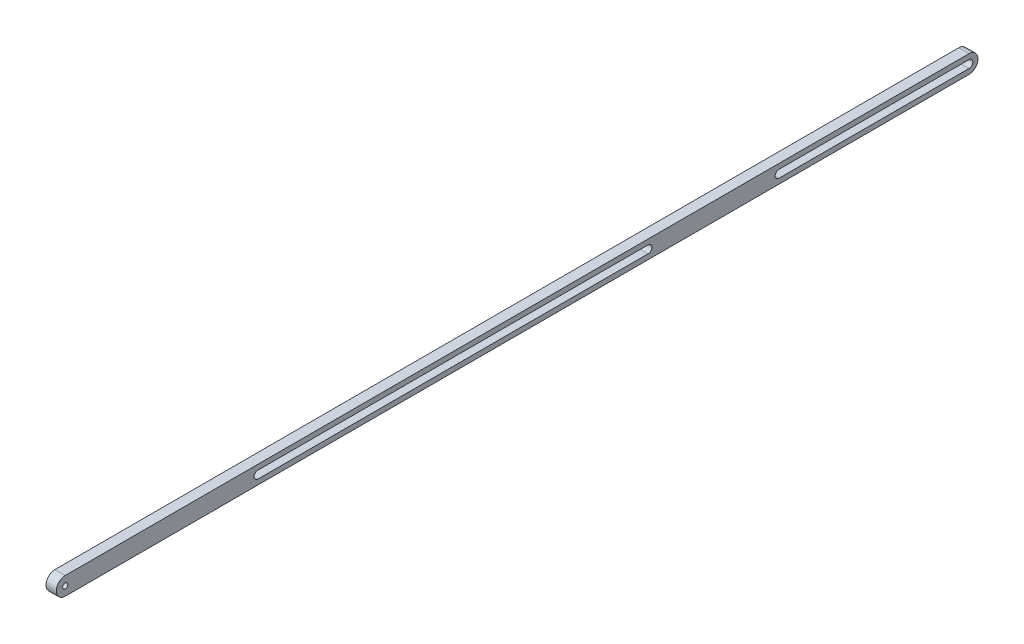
ISO-10303-21;
HEADER;
FILE_DESCRIPTION(('STEP AP214'),'2;1');
FILE_NAME('part.step','',(''),(''),'','','');
FILE_SCHEMA(('AUTOMOTIVE_DESIGN { 1 0 10303 214 1 1 1 1 }'));
ENDSEC;
DATA;
#1=APPLICATION_CONTEXT('core data for automotive mechanical design processes');
#2=APPLICATION_PROTOCOL_DEFINITION('international standard','automotive_design',2000,#1);
#3=PRODUCT_CONTEXT('',#1,'mechanical');
#4=PRODUCT('Part','Part','',(#3));
#5=PRODUCT_RELATED_PRODUCT_CATEGORY('part','',(#4));
#6=PRODUCT_DEFINITION_FORMATION('','',#4);
#7=PRODUCT_DEFINITION_CONTEXT('part definition',#1,'design');
#8=PRODUCT_DEFINITION('design','',#6,#7);
#9=PRODUCT_DEFINITION_SHAPE('','',#8);
#10=(LENGTH_UNIT() NAMED_UNIT(*) SI_UNIT(.MILLI.,.METRE.));
#11=(NAMED_UNIT(*) PLANE_ANGLE_UNIT() SI_UNIT($,.RADIAN.));
#12=(NAMED_UNIT(*) SI_UNIT($,.STERADIAN.) SOLID_ANGLE_UNIT());
#13=UNCERTAINTY_MEASURE_WITH_UNIT(LENGTH_MEASURE(1.E-05),#10,'distance_accuracy_value','');
#14=(GEOMETRIC_REPRESENTATION_CONTEXT(3) GLOBAL_UNCERTAINTY_ASSIGNED_CONTEXT((#13)) GLOBAL_UNIT_ASSIGNED_CONTEXT((#10,
#11,#12)) REPRESENTATION_CONTEXT('',''));
#15=CARTESIAN_POINT('',(0.,0.,0.));
#16=DIRECTION('',(0.,0.,1.));
#17=DIRECTION('',(1.,0.,0.));
#18=AXIS2_PLACEMENT_3D('',#15,#16,#17);
#19=CARTESIAN_POINT('',(20.,0.,0.));
#20=DIRECTION('',(1.,0.,0.));
#21=DIRECTION('',(0.,0.,-1.));
#22=AXIS2_PLACEMENT_3D('',#19,#20,#21);
#23=PLANE('',#22);
#24=DIRECTION('',(0.,0.,-1.));
#25=VECTOR('',#24,1.);
#26=CARTESIAN_POINT('',(20.,-7.5,-375.));
#27=LINE('',#26,#25);
#28=CARTESIAN_POINT('',(20.,-7.5,-375.));
#29=VERTEX_POINT('',#28);
#30=CARTESIAN_POINT('',(20.,-7.5,-1135.));
#31=VERTEX_POINT('',#30);
#32=EDGE_CURVE('E163',#29,#31,#27,.T.);
#33=ORIENTED_EDGE('',*,*,#32,.F.);
#34=CARTESIAN_POINT('',(20.,0.,-375.));
#35=DIRECTION('',(1.,0.,0.));
#36=DIRECTION('',(0.,0.,-1.));
#37=AXIS2_PLACEMENT_3D('',#34,#35,#36);
#38=CIRCLE('',#37,7.5);
#39=CARTESIAN_POINT('',(20.,7.5,-375.));
#40=VERTEX_POINT('',#39);
#41=EDGE_CURVE('E161',#40,#29,#38,.T.);
#42=ORIENTED_EDGE('',*,*,#41,.F.);
#43=DIRECTION('',(0.,0.,1.));
#44=VECTOR('',#43,1.);
#45=CARTESIAN_POINT('',(20.,7.5,-375.));
#46=LINE('',#45,#44);
#47=CARTESIAN_POINT('',(20.,7.5,-1135.));
#48=VERTEX_POINT('',#47);
#49=EDGE_CURVE('E169',#48,#40,#46,.T.);
#50=ORIENTED_EDGE('',*,*,#49,.F.);
#51=CARTESIAN_POINT('',(20.,0.,-1135.));
#52=DIRECTION('',(1.,0.,0.));
#53=DIRECTION('',(0.,0.,-1.));
#54=AXIS2_PLACEMENT_3D('',#51,#52,#53);
#55=CIRCLE('',#54,7.5);
#56=EDGE_CURVE('E166',#31,#48,#55,.T.);
#57=ORIENTED_EDGE('',*,*,#56,.F.);
#58=EDGE_LOOP('',(#33,#42,#50,#57));
#59=FACE_BOUND('',#58,.T.);
#60=CARTESIAN_POINT('',(20.,0.,0.));
#61=DIRECTION('',(1.,0.,0.));
#62=DIRECTION('',(0.,0.,-1.));
#63=AXIS2_PLACEMENT_3D('',#60,#61,#62);
#64=CIRCLE('',#63,17.5);
#65=CARTESIAN_POINT('',(20.,17.5,0.));
#66=VERTEX_POINT('',#65);
#67=CARTESIAN_POINT('',(20.,-17.5,0.));
#68=VERTEX_POINT('',#67);
#69=EDGE_CURVE('E198',#66,#68,#64,.T.);
#70=ORIENTED_EDGE('',*,*,#69,.T.);
#71=DIRECTION('',(0.,0.,-1.));
#72=VECTOR('',#71,1.);
#73=CARTESIAN_POINT('',(20.,-17.5,0.));
#74=LINE('',#73,#72);
#75=CARTESIAN_POINT('',(20.,-17.5,-1760.));
#76=VERTEX_POINT('',#75);
#77=EDGE_CURVE('E201',#68,#76,#74,.T.);
#78=ORIENTED_EDGE('',*,*,#77,.T.);
#79=CARTESIAN_POINT('',(20.,0.,-1760.));
#80=DIRECTION('',(1.,0.,0.));
#81=DIRECTION('',(0.,0.,-1.));
#82=AXIS2_PLACEMENT_3D('',#79,#80,#81);
#83=CIRCLE('',#82,17.5);
#84=CARTESIAN_POINT('',(20.,17.5,-1760.));
#85=VERTEX_POINT('',#84);
#86=EDGE_CURVE('E204',#76,#85,#83,.T.);
#87=ORIENTED_EDGE('',*,*,#86,.T.);
#88=DIRECTION('',(0.,0.,1.));
#89=VECTOR('',#88,1.);
#90=CARTESIAN_POINT('',(20.,17.5,0.));
#91=LINE('',#90,#89);
#92=EDGE_CURVE('E206',#85,#66,#91,.T.);
#93=ORIENTED_EDGE('',*,*,#92,.T.);
#94=EDGE_LOOP('',(#70,#78,#87,#93));
#95=FACE_BOUND('',#94,.T.);
#96=CARTESIAN_POINT('',(20.,0.,0.));
#97=DIRECTION('',(1.,0.,0.));
#98=DIRECTION('',(0.,0.,-1.));
#99=AXIS2_PLACEMENT_3D('',#96,#97,#98);
#100=CIRCLE('',#99,5.);
#101=CARTESIAN_POINT('',(20.,0.,-5.));
#102=VERTEX_POINT('',#101);
#103=EDGE_CURVE('E192',#102,#102,#100,.T.);
#104=ORIENTED_EDGE('',*,*,#103,.F.);
#105=EDGE_LOOP('',(#104));
#106=FACE_BOUND('',#105,.T.);
#107=DIRECTION('',(0.,0.,1.));
#108=VECTOR('',#107,1.);
#109=CARTESIAN_POINT('',(20.,7.50000000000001,-1760.));
#110=LINE('',#109,#108);
#111=CARTESIAN_POINT('',(20.,7.50000000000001,-1760.));
#112=VERTEX_POINT('',#111);
#113=CARTESIAN_POINT('',(20.,7.49999999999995,-1390.));
#114=VERTEX_POINT('',#113);
#115=EDGE_CURVE('E133',#112,#114,#110,.T.);
#116=ORIENTED_EDGE('',*,*,#115,.F.);
#117=CARTESIAN_POINT('',(20.,0.,-1760.));
#118=DIRECTION('',(1.,0.,0.));
#119=DIRECTION('',(0.,0.,-1.));
#120=AXIS2_PLACEMENT_3D('',#117,#118,#119);
#121=CIRCLE('',#120,7.5);
#122=CARTESIAN_POINT('',(20.,-7.49999999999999,-1760.));
#123=VERTEX_POINT('',#122);
#124=EDGE_CURVE('E125',#123,#112,#121,.T.);
#125=ORIENTED_EDGE('',*,*,#124,.F.);
#126=DIRECTION('',(0.,0.,-1.));
#127=VECTOR('',#126,1.);
#128=CARTESIAN_POINT('',(20.,-7.49999999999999,-1760.));
#129=LINE('',#128,#127);
#130=CARTESIAN_POINT('',(20.,-7.50000000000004,-1390.));
#131=VERTEX_POINT('',#130);
#132=EDGE_CURVE('E147',#131,#123,#129,.T.);
#133=ORIENTED_EDGE('',*,*,#132,.F.);
#134=CARTESIAN_POINT('',(20.,0.,-1390.));
#135=DIRECTION('',(1.,0.,0.));
#136=DIRECTION('',(0.,0.,-1.));
#137=AXIS2_PLACEMENT_3D('',#134,#135,#136);
#138=CIRCLE('',#137,7.5);
#139=EDGE_CURVE('E145',#114,#131,#138,.T.);
#140=ORIENTED_EDGE('',*,*,#139,.F.);
#141=EDGE_LOOP('',(#116,#125,#133,#140));
#142=FACE_BOUND('',#141,.T.);
#143=ADVANCED_FACE('F36',(#59,#95,#106,#142),#23,.T.);
#144=CARTESIAN_POINT('',(0.,0.,0.));
#145=DIRECTION('',(1.,0.,0.));
#146=DIRECTION('',(0.,0.,-1.));
#147=AXIS2_PLACEMENT_3D('',#144,#145,#146);
#148=PLANE('',#147);
#149=CARTESIAN_POINT('',(0.,0.,-375.));
#150=DIRECTION('',(1.,0.,0.));
#151=DIRECTION('',(0.,0.,-1.));
#152=AXIS2_PLACEMENT_3D('',#149,#150,#151);
#153=CIRCLE('',#152,7.5);
#154=CARTESIAN_POINT('',(0.,7.5,-375.));
#155=VERTEX_POINT('',#154);
#156=CARTESIAN_POINT('',(0.,-7.5,-375.));
#157=VERTEX_POINT('',#156);
#158=EDGE_CURVE('E141',#155,#157,#153,.T.);
#159=ORIENTED_EDGE('',*,*,#158,.T.);
#160=DIRECTION('',(0.,0.,-1.));
#161=VECTOR('',#160,1.);
#162=CARTESIAN_POINT('',(0.,-7.5,-375.));
#163=LINE('',#162,#161);
#164=CARTESIAN_POINT('',(0.,-7.5,-1135.));
#165=VERTEX_POINT('',#164);
#166=EDGE_CURVE('E174',#157,#165,#163,.T.);
#167=ORIENTED_EDGE('',*,*,#166,.T.);
#168=CARTESIAN_POINT('',(0.,0.,-1135.));
#169=DIRECTION('',(1.,0.,0.));
#170=DIRECTION('',(0.,0.,-1.));
#171=AXIS2_PLACEMENT_3D('',#168,#169,#170);
#172=CIRCLE('',#171,7.5);
#173=CARTESIAN_POINT('',(0.,7.5,-1135.));
#174=VERTEX_POINT('',#173);
#175=EDGE_CURVE('E177',#165,#174,#172,.T.);
#176=ORIENTED_EDGE('',*,*,#175,.T.);
#177=DIRECTION('',(0.,0.,1.));
#178=VECTOR('',#177,1.);
#179=CARTESIAN_POINT('',(0.,7.5,-375.));
#180=LINE('',#179,#178);
#181=EDGE_CURVE('E164',#174,#155,#180,.T.);
#182=ORIENTED_EDGE('',*,*,#181,.T.);
#183=EDGE_LOOP('',(#159,#167,#176,#182));
#184=FACE_BOUND('',#183,.T.);
#185=CARTESIAN_POINT('',(0.,0.,0.));
#186=DIRECTION('',(1.,0.,0.));
#187=DIRECTION('',(0.,0.,-1.));
#188=AXIS2_PLACEMENT_3D('',#185,#186,#187);
#189=CIRCLE('',#188,17.5);
#190=CARTESIAN_POINT('',(0.,17.5,0.));
#191=VERTEX_POINT('',#190);
#192=CARTESIAN_POINT('',(0.,-17.5,0.));
#193=VERTEX_POINT('',#192);
#194=EDGE_CURVE('E195',#191,#193,#189,.T.);
#195=ORIENTED_EDGE('',*,*,#194,.F.);
#196=DIRECTION('',(0.,0.,1.));
#197=VECTOR('',#196,1.);
#198=CARTESIAN_POINT('',(0.,17.5,0.));
#199=LINE('',#198,#197);
#200=CARTESIAN_POINT('',(0.,17.5,-1760.));
#201=VERTEX_POINT('',#200);
#202=EDGE_CURVE('E202',#201,#191,#199,.T.);
#203=ORIENTED_EDGE('',*,*,#202,.F.);
#204=CARTESIAN_POINT('',(0.,0.,-1760.));
#205=DIRECTION('',(1.,0.,0.));
#206=DIRECTION('',(0.,0.,-1.));
#207=AXIS2_PLACEMENT_3D('',#204,#205,#206);
#208=CIRCLE('',#207,17.5);
#209=CARTESIAN_POINT('',(0.,-17.5,-1760.));
#210=VERTEX_POINT('',#209);
#211=EDGE_CURVE('E213',#210,#201,#208,.T.);
#212=ORIENTED_EDGE('',*,*,#211,.F.);
#213=DIRECTION('',(0.,0.,-1.));
#214=VECTOR('',#213,1.);
#215=CARTESIAN_POINT('',(0.,-17.5,0.));
#216=LINE('',#215,#214);
#217=EDGE_CURVE('E211',#193,#210,#216,.T.);
#218=ORIENTED_EDGE('',*,*,#217,.F.);
#219=EDGE_LOOP('',(#195,#203,#212,#218));
#220=FACE_BOUND('',#219,.T.);
#221=CARTESIAN_POINT('',(0.,0.,0.));
#222=DIRECTION('',(1.,0.,0.));
#223=DIRECTION('',(0.,0.,-1.));
#224=AXIS2_PLACEMENT_3D('',#221,#222,#223);
#225=CIRCLE('',#224,5.);
#226=CARTESIAN_POINT('',(0.,0.,-5.));
#227=VERTEX_POINT('',#226);
#228=EDGE_CURVE('E191',#227,#227,#225,.T.);
#229=ORIENTED_EDGE('',*,*,#228,.T.);
#230=EDGE_LOOP('',(#229));
#231=FACE_BOUND('',#230,.T.);
#232=CARTESIAN_POINT('',(0.,0.,-1760.));
#233=DIRECTION('',(1.,0.,0.));
#234=DIRECTION('',(0.,0.,-1.));
#235=AXIS2_PLACEMENT_3D('',#232,#233,#234);
#236=CIRCLE('',#235,7.5);
#237=CARTESIAN_POINT('',(0.,-7.49999999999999,-1760.));
#238=VERTEX_POINT('',#237);
#239=CARTESIAN_POINT('',(0.,7.50000000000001,-1760.));
#240=VERTEX_POINT('',#239);
#241=EDGE_CURVE('E59',#238,#240,#236,.T.);
#242=ORIENTED_EDGE('',*,*,#241,.T.);
#243=DIRECTION('',(0.,0.,1.));
#244=VECTOR('',#243,1.);
#245=CARTESIAN_POINT('',(0.,7.50000000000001,-1760.));
#246=LINE('',#245,#244);
#247=CARTESIAN_POINT('',(0.,7.49999999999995,-1390.));
#248=VERTEX_POINT('',#247);
#249=EDGE_CURVE('E140',#240,#248,#246,.T.);
#250=ORIENTED_EDGE('',*,*,#249,.T.);
#251=CARTESIAN_POINT('',(0.,0.,-1390.));
#252=DIRECTION('',(1.,0.,0.));
#253=DIRECTION('',(0.,0.,-1.));
#254=AXIS2_PLACEMENT_3D('',#251,#252,#253);
#255=CIRCLE('',#254,7.5);
#256=CARTESIAN_POINT('',(0.,-7.50000000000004,-1390.));
#257=VERTEX_POINT('',#256);
#258=EDGE_CURVE('E153',#248,#257,#255,.T.);
#259=ORIENTED_EDGE('',*,*,#258,.T.);
#260=DIRECTION('',(0.,0.,-1.));
#261=VECTOR('',#260,1.);
#262=CARTESIAN_POINT('',(0.,-7.49999999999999,-1760.));
#263=LINE('',#262,#261);
#264=EDGE_CURVE('E134',#257,#238,#263,.T.);
#265=ORIENTED_EDGE('',*,*,#264,.T.);
#266=EDGE_LOOP('',(#242,#250,#259,#265));
#267=FACE_BOUND('',#266,.T.);
#268=ADVANCED_FACE('F231',(#184,#220,#231,#267),#148,.F.);
#269=CARTESIAN_POINT('',(20.,0.,0.));
#270=DIRECTION('',(-1.,0.,0.));
#271=DIRECTION('',(0.,0.,1.));
#272=AXIS2_PLACEMENT_3D('',#269,#270,#271);
#273=CYLINDRICAL_SURFACE('',#272,17.5);
#274=ORIENTED_EDGE('',*,*,#194,.T.);
#275=DIRECTION('',(-1.,0.,0.));
#276=VECTOR('',#275,1.);
#277=CARTESIAN_POINT('',(20.,-17.5,0.));
#278=LINE('',#277,#276);
#279=EDGE_CURVE('E11',#68,#193,#278,.T.);
#280=ORIENTED_EDGE('',*,*,#279,.F.);
#281=ORIENTED_EDGE('',*,*,#69,.F.);
#282=DIRECTION('',(-1.,0.,0.));
#283=VECTOR('',#282,1.);
#284=CARTESIAN_POINT('',(20.,17.5,0.));
#285=LINE('',#284,#283);
#286=EDGE_CURVE('E208',#66,#191,#285,.T.);
#287=ORIENTED_EDGE('',*,*,#286,.T.);
#288=EDGE_LOOP('',(#274,#280,#281,#287));
#289=FACE_BOUND('',#288,.T.);
#290=ADVANCED_FACE('F38',(#289),#273,.T.);
#291=CARTESIAN_POINT('',(20.,-17.5,0.));
#292=DIRECTION('',(0.,1.,0.));
#293=DIRECTION('',(0.,0.,1.));
#294=AXIS2_PLACEMENT_3D('',#291,#292,#293);
#295=PLANE('',#294);
#296=ORIENTED_EDGE('',*,*,#217,.T.);
#297=DIRECTION('',(-1.,0.,0.));
#298=VECTOR('',#297,1.);
#299=CARTESIAN_POINT('',(20.,-17.5,-1760.));
#300=LINE('',#299,#298);
#301=EDGE_CURVE('E44',#76,#210,#300,.T.);
#302=ORIENTED_EDGE('',*,*,#301,.F.);
#303=ORIENTED_EDGE('',*,*,#77,.F.);
#304=ORIENTED_EDGE('',*,*,#279,.T.);
#305=EDGE_LOOP('',(#296,#302,#303,#304));
#306=FACE_BOUND('',#305,.T.);
#307=ADVANCED_FACE('F242',(#306),#295,.F.);
#308=CARTESIAN_POINT('',(20.,0.,-1760.));
#309=DIRECTION('',(-1.,0.,0.));
#310=DIRECTION('',(0.,0.,1.));
#311=AXIS2_PLACEMENT_3D('',#308,#309,#310);
#312=CYLINDRICAL_SURFACE('',#311,17.5);
#313=ORIENTED_EDGE('',*,*,#211,.T.);
#314=DIRECTION('',(-1.,0.,0.));
#315=VECTOR('',#314,1.);
#316=CARTESIAN_POINT('',(20.,17.5,-1760.));
#317=LINE('',#316,#315);
#318=EDGE_CURVE('E218',#85,#201,#317,.T.);
#319=ORIENTED_EDGE('',*,*,#318,.F.);
#320=ORIENTED_EDGE('',*,*,#86,.F.);
#321=ORIENTED_EDGE('',*,*,#301,.T.);
#322=EDGE_LOOP('',(#313,#319,#320,#321));
#323=FACE_BOUND('',#322,.T.);
#324=ADVANCED_FACE('F225',(#323),#312,.T.);
#325=CARTESIAN_POINT('',(20.,17.5,0.));
#326=DIRECTION('',(0.,-1.,0.));
#327=DIRECTION('',(0.,0.,-1.));
#328=AXIS2_PLACEMENT_3D('',#325,#326,#327);
#329=PLANE('',#328);
#330=ORIENTED_EDGE('',*,*,#202,.T.);
#331=ORIENTED_EDGE('',*,*,#286,.F.);
#332=ORIENTED_EDGE('',*,*,#92,.F.);
#333=ORIENTED_EDGE('',*,*,#318,.T.);
#334=EDGE_LOOP('',(#330,#331,#332,#333));
#335=FACE_BOUND('',#334,.T.);
#336=ADVANCED_FACE('F235',(#335),#329,.F.);
#337=CARTESIAN_POINT('',(20.,0.,0.));
#338=DIRECTION('',(-1.,0.,0.));
#339=DIRECTION('',(0.,0.,1.));
#340=AXIS2_PLACEMENT_3D('',#337,#338,#339);
#341=CYLINDRICAL_SURFACE('',#340,5.);
#342=ORIENTED_EDGE('',*,*,#103,.T.);
#343=EDGE_LOOP('',(#342));
#344=FACE_BOUND('',#343,.T.);
#345=ORIENTED_EDGE('',*,*,#228,.F.);
#346=EDGE_LOOP('',(#345));
#347=FACE_BOUND('',#346,.T.);
#348=ADVANCED_FACE('F259',(#344,#347),#341,.F.);
#349=CARTESIAN_POINT('',(20.,0.,-375.));
#350=DIRECTION('',(-1.,0.,0.));
#351=DIRECTION('',(0.,0.,1.));
#352=AXIS2_PLACEMENT_3D('',#349,#350,#351);
#353=CYLINDRICAL_SURFACE('',#352,7.5);
#354=ORIENTED_EDGE('',*,*,#158,.F.);
#355=DIRECTION('',(-1.,0.,0.));
#356=VECTOR('',#355,1.);
#357=CARTESIAN_POINT('',(20.,7.5,-375.));
#358=LINE('',#357,#356);
#359=EDGE_CURVE('E171',#40,#155,#358,.T.);
#360=ORIENTED_EDGE('',*,*,#359,.F.);
#361=ORIENTED_EDGE('',*,*,#41,.T.);
#362=DIRECTION('',(-1.,0.,0.));
#363=VECTOR('',#362,1.);
#364=CARTESIAN_POINT('',(20.,-7.5,-375.));
#365=LINE('',#364,#363);
#366=EDGE_CURVE('E188',#29,#157,#365,.T.);
#367=ORIENTED_EDGE('',*,*,#366,.T.);
#368=EDGE_LOOP('',(#354,#360,#361,#367));
#369=FACE_BOUND('',#368,.T.);
#370=ADVANCED_FACE('F266',(#369),#353,.F.);
#371=CARTESIAN_POINT('',(20.,-7.5,-375.));
#372=DIRECTION('',(0.,1.,0.));
#373=DIRECTION('',(0.,0.,1.));
#374=AXIS2_PLACEMENT_3D('',#371,#372,#373);
#375=PLANE('',#374);
#376=ORIENTED_EDGE('',*,*,#166,.F.);
#377=ORIENTED_EDGE('',*,*,#366,.F.);
#378=ORIENTED_EDGE('',*,*,#32,.T.);
#379=DIRECTION('',(-1.,0.,0.));
#380=VECTOR('',#379,1.);
#381=CARTESIAN_POINT('',(20.,-7.5,-1135.));
#382=LINE('',#381,#380);
#383=EDGE_CURVE('E186',#31,#165,#382,.T.);
#384=ORIENTED_EDGE('',*,*,#383,.T.);
#385=EDGE_LOOP('',(#376,#377,#378,#384));
#386=FACE_BOUND('',#385,.T.);
#387=ADVANCED_FACE('F271',(#386),#375,.T.);
#388=CARTESIAN_POINT('',(20.,0.,-1135.));
#389=DIRECTION('',(-1.,0.,0.));
#390=DIRECTION('',(0.,0.,1.));
#391=AXIS2_PLACEMENT_3D('',#388,#389,#390);
#392=CYLINDRICAL_SURFACE('',#391,7.5);
#393=ORIENTED_EDGE('',*,*,#175,.F.);
#394=ORIENTED_EDGE('',*,*,#383,.F.);
#395=ORIENTED_EDGE('',*,*,#56,.T.);
#396=DIRECTION('',(-1.,0.,0.));
#397=VECTOR('',#396,1.);
#398=CARTESIAN_POINT('',(20.,7.5,-1135.));
#399=LINE('',#398,#397);
#400=EDGE_CURVE('E184',#48,#174,#399,.T.);
#401=ORIENTED_EDGE('',*,*,#400,.T.);
#402=EDGE_LOOP('',(#393,#394,#395,#401));
#403=FACE_BOUND('',#402,.T.);
#404=ADVANCED_FACE('F295',(#403),#392,.F.);
#405=CARTESIAN_POINT('',(20.,7.5,-375.));
#406=DIRECTION('',(0.,-1.,0.));
#407=DIRECTION('',(0.,0.,-1.));
#408=AXIS2_PLACEMENT_3D('',#405,#406,#407);
#409=PLANE('',#408);
#410=ORIENTED_EDGE('',*,*,#181,.F.);
#411=ORIENTED_EDGE('',*,*,#400,.F.);
#412=ORIENTED_EDGE('',*,*,#49,.T.);
#413=ORIENTED_EDGE('',*,*,#359,.T.);
#414=EDGE_LOOP('',(#410,#411,#412,#413));
#415=FACE_BOUND('',#414,.T.);
#416=ADVANCED_FACE('F292',(#415),#409,.T.);
#417=CARTESIAN_POINT('',(20.,0.,-1760.));
#418=DIRECTION('',(-1.,0.,0.));
#419=DIRECTION('',(0.,0.,1.));
#420=AXIS2_PLACEMENT_3D('',#417,#418,#419);
#421=CYLINDRICAL_SURFACE('',#420,7.5);
#422=ORIENTED_EDGE('',*,*,#241,.F.);
#423=DIRECTION('',(-1.,0.,0.));
#424=VECTOR('',#423,1.);
#425=CARTESIAN_POINT('',(20.,-7.49999999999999,-1760.));
#426=LINE('',#425,#424);
#427=EDGE_CURVE('E129',#123,#238,#426,.T.);
#428=ORIENTED_EDGE('',*,*,#427,.F.);
#429=ORIENTED_EDGE('',*,*,#124,.T.);
#430=DIRECTION('',(-1.,0.,0.));
#431=VECTOR('',#430,1.);
#432=CARTESIAN_POINT('',(20.,7.50000000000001,-1760.));
#433=LINE('',#432,#431);
#434=EDGE_CURVE('E128',#112,#240,#433,.T.);
#435=ORIENTED_EDGE('',*,*,#434,.T.);
#436=EDGE_LOOP('',(#422,#428,#429,#435));
#437=FACE_BOUND('',#436,.T.);
#438=ADVANCED_FACE('F127',(#437),#421,.F.);
#439=CARTESIAN_POINT('',(20.,7.50000000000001,-1760.));
#440=DIRECTION('',(0.,-1.,0.));
#441=DIRECTION('',(0.,0.,-1.));
#442=AXIS2_PLACEMENT_3D('',#439,#440,#441);
#443=PLANE('',#442);
#444=ORIENTED_EDGE('',*,*,#249,.F.);
#445=ORIENTED_EDGE('',*,*,#434,.F.);
#446=ORIENTED_EDGE('',*,*,#115,.T.);
#447=DIRECTION('',(-1.,0.,0.));
#448=VECTOR('',#447,1.);
#449=CARTESIAN_POINT('',(20.,7.49999999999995,-1390.));
#450=LINE('',#449,#448);
#451=EDGE_CURVE('E142',#114,#248,#450,.T.);
#452=ORIENTED_EDGE('',*,*,#451,.T.);
#453=EDGE_LOOP('',(#444,#445,#446,#452));
#454=FACE_BOUND('',#453,.T.);
#455=ADVANCED_FACE('F137',(#454),#443,.T.);
#456=CARTESIAN_POINT('',(20.,0.,-1390.));
#457=DIRECTION('',(-1.,0.,0.));
#458=DIRECTION('',(0.,0.,1.));
#459=AXIS2_PLACEMENT_3D('',#456,#457,#458);
#460=CYLINDRICAL_SURFACE('',#459,7.5);
#461=ORIENTED_EDGE('',*,*,#258,.F.);
#462=ORIENTED_EDGE('',*,*,#451,.F.);
#463=ORIENTED_EDGE('',*,*,#139,.T.);
#464=DIRECTION('',(-1.,0.,0.));
#465=VECTOR('',#464,1.);
#466=CARTESIAN_POINT('',(20.,-7.50000000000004,-1390.));
#467=LINE('',#466,#465);
#468=EDGE_CURVE('E51',#131,#257,#467,.T.);
#469=ORIENTED_EDGE('',*,*,#468,.T.);
#470=EDGE_LOOP('',(#461,#462,#463,#469));
#471=FACE_BOUND('',#470,.T.);
#472=ADVANCED_FACE('F280',(#471),#460,.F.);
#473=CARTESIAN_POINT('',(20.,-7.49999999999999,-1760.));
#474=DIRECTION('',(0.,1.,0.));
#475=DIRECTION('',(0.,0.,1.));
#476=AXIS2_PLACEMENT_3D('',#473,#474,#475);
#477=PLANE('',#476);
#478=ORIENTED_EDGE('',*,*,#264,.F.);
#479=ORIENTED_EDGE('',*,*,#468,.F.);
#480=ORIENTED_EDGE('',*,*,#132,.T.);
#481=ORIENTED_EDGE('',*,*,#427,.T.);
#482=EDGE_LOOP('',(#478,#479,#480,#481));
#483=FACE_BOUND('',#482,.T.);
#484=ADVANCED_FACE('F278',(#483),#477,.T.);
#485=CLOSED_SHELL('',(#143,#268,#290,#307,#324,#336,#348,#370,#387,#404,#416,#438,#455,#472,#484));
#486=MANIFOLD_SOLID_BREP('B2',#485);
#487=ADVANCED_BREP_SHAPE_REPRESENTATION('',(#18,#486),#14);
#488=SHAPE_DEFINITION_REPRESENTATION(#9,#487);
ENDSEC;
END-ISO-10303-21;
